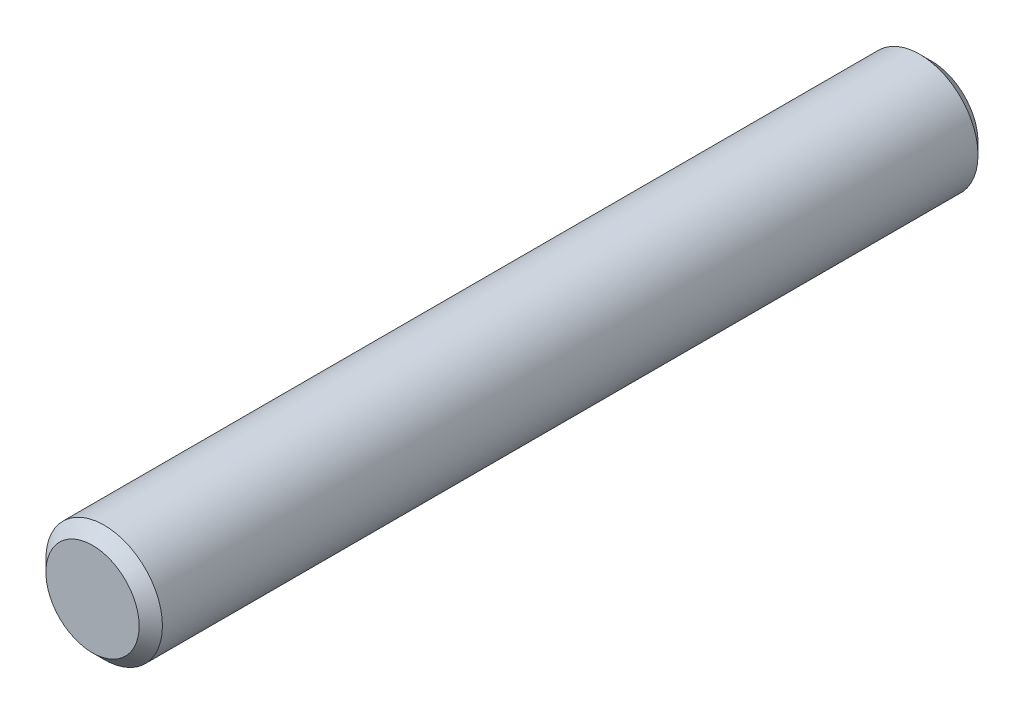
ISO-10303-21;
HEADER;
FILE_DESCRIPTION(('STEP AP214'),'2;1');
FILE_NAME('part.step','',(''),(''),'','','');
FILE_SCHEMA(('AUTOMOTIVE_DESIGN { 1 0 10303 214 1 1 1 1 }'));
ENDSEC;
DATA;
#1=APPLICATION_CONTEXT('core data for automotive mechanical design processes');
#2=APPLICATION_PROTOCOL_DEFINITION('international standard','automotive_design',2000,#1);
#3=PRODUCT_CONTEXT('',#1,'mechanical');
#4=PRODUCT('Part','Part','',(#3));
#5=PRODUCT_RELATED_PRODUCT_CATEGORY('part','',(#4));
#6=PRODUCT_DEFINITION_FORMATION('','',#4);
#7=PRODUCT_DEFINITION_CONTEXT('part definition',#1,'design');
#8=PRODUCT_DEFINITION('design','',#6,#7);
#9=PRODUCT_DEFINITION_SHAPE('','',#8);
#10=(LENGTH_UNIT() NAMED_UNIT(*) SI_UNIT(.MILLI.,.METRE.));
#11=(NAMED_UNIT(*) PLANE_ANGLE_UNIT() SI_UNIT($,.RADIAN.));
#12=(NAMED_UNIT(*) SI_UNIT($,.STERADIAN.) SOLID_ANGLE_UNIT());
#13=UNCERTAINTY_MEASURE_WITH_UNIT(LENGTH_MEASURE(1.E-05),#10,'distance_accuracy_value','');
#14=(GEOMETRIC_REPRESENTATION_CONTEXT(3) GLOBAL_UNCERTAINTY_ASSIGNED_CONTEXT((#13)) GLOBAL_UNIT_ASSIGNED_CONTEXT((#10,
#11,#12)) REPRESENTATION_CONTEXT('',''));
#15=CARTESIAN_POINT('',(0.,0.,0.));
#16=DIRECTION('',(0.,0.,1.));
#17=DIRECTION('',(1.,0.,0.));
#18=AXIS2_PLACEMENT_3D('',#15,#16,#17);
#19=CARTESIAN_POINT('',(-11.8089324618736,14.6289760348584,72.));
#20=DIRECTION('',(0.,0.,-1.));
#21=DIRECTION('',(-1.,0.,0.));
#22=AXIS2_PLACEMENT_3D('',#19,#20,#21);
#23=CYLINDRICAL_SURFACE('',#22,5.);
#24=CARTESIAN_POINT('',(-11.8089324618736,14.6289760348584,1.00000000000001));
#25=DIRECTION('',(0.,0.,1.));
#26=DIRECTION('',(1.,0.,0.));
#27=AXIS2_PLACEMENT_3D('',#24,#25,#26);
#28=CIRCLE('',#27,5.);
#29=CARTESIAN_POINT('',(-6.80893246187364,14.6289760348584,1.00000000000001));
#30=VERTEX_POINT('',#29);
#31=EDGE_CURVE('E39',#30,#30,#28,.T.);
#32=ORIENTED_EDGE('',*,*,#31,.T.);
#33=EDGE_LOOP('',(#32));
#34=FACE_BOUND('',#33,.T.);
#35=CARTESIAN_POINT('',(-11.8089324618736,14.6289760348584,71.));
#36=DIRECTION('',(0.,0.,1.));
#37=DIRECTION('',(1.,0.,0.));
#38=AXIS2_PLACEMENT_3D('',#35,#36,#37);
#39=CIRCLE('',#38,5.);
#40=CARTESIAN_POINT('',(-6.80893246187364,14.6289760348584,71.));
#41=VERTEX_POINT('',#40);
#42=EDGE_CURVE('E43',#41,#41,#39,.F.);
#43=ORIENTED_EDGE('',*,*,#42,.T.);
#44=EDGE_LOOP('',(#43));
#45=FACE_BOUND('',#44,.T.);
#46=ADVANCED_FACE('F28',(#34,#45),#23,.T.);
#47=CARTESIAN_POINT('',(-11.8089324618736,14.6289760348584,72.));
#48=DIRECTION('',(0.,0.,1.));
#49=DIRECTION('',(1.,0.,0.));
#50=AXIS2_PLACEMENT_3D('',#47,#48,#49);
#51=PLANE('',#50);
#52=CARTESIAN_POINT('',(-11.8089324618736,14.6289760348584,72.));
#53=DIRECTION('',(0.,0.,1.));
#54=DIRECTION('',(1.,0.,0.));
#55=AXIS2_PLACEMENT_3D('',#52,#53,#54);
#56=CIRCLE('',#55,4.);
#57=CARTESIAN_POINT('',(-7.80893246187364,14.6289760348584,72.));
#58=VERTEX_POINT('',#57);
#59=EDGE_CURVE('E10',#58,#58,#56,.T.);
#60=ORIENTED_EDGE('',*,*,#59,.T.);
#61=EDGE_LOOP('',(#60));
#62=FACE_BOUND('',#61,.T.);
#63=ADVANCED_FACE('F59',(#62),#51,.T.);
#64=CARTESIAN_POINT('',(-11.8089324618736,14.6289760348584,0.));
#65=DIRECTION('',(0.,0.,1.));
#66=DIRECTION('',(1.,0.,0.));
#67=AXIS2_PLACEMENT_3D('',#64,#65,#66);
#68=PLANE('',#67);
#69=CARTESIAN_POINT('',(-11.8089324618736,14.6289760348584,0.));
#70=DIRECTION('',(0.,0.,1.));
#71=DIRECTION('',(1.,0.,0.));
#72=AXIS2_PLACEMENT_3D('',#69,#70,#71);
#73=CIRCLE('',#72,4.);
#74=CARTESIAN_POINT('',(-7.80893246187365,14.6289760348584,0.));
#75=VERTEX_POINT('',#74);
#76=EDGE_CURVE('E35',#75,#75,#73,.F.);
#77=ORIENTED_EDGE('',*,*,#76,.T.);
#78=EDGE_LOOP('',(#77));
#79=FACE_BOUND('',#78,.T.);
#80=ADVANCED_FACE('F56',(#79),#68,.F.);
#81=CARTESIAN_POINT('',(-11.8089324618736,14.6289760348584,1.00000000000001));
#82=DIRECTION('',(0.,0.,1.));
#83=DIRECTION('',(1.,0.,0.));
#84=AXIS2_PLACEMENT_3D('',#81,#82,#83);
#85=CONICAL_SURFACE('',#84,5.,0.785398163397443);
#86=ORIENTED_EDGE('',*,*,#76,.F.);
#87=EDGE_LOOP('',(#86));
#88=FACE_BOUND('',#87,.T.);
#89=ORIENTED_EDGE('',*,*,#31,.F.);
#90=EDGE_LOOP('',(#89));
#91=FACE_BOUND('',#90,.T.);
#92=ADVANCED_FACE('F52',(#88,#91),#85,.T.);
#93=CARTESIAN_POINT('',(-11.8089324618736,14.6289760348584,72.));
#94=DIRECTION('',(0.,0.,-1.));
#95=DIRECTION('',(-1.,0.,0.));
#96=AXIS2_PLACEMENT_3D('',#93,#94,#95);
#97=CONICAL_SURFACE('',#96,4.,0.785398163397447);
#98=ORIENTED_EDGE('',*,*,#42,.F.);
#99=EDGE_LOOP('',(#98));
#100=FACE_BOUND('',#99,.T.);
#101=ORIENTED_EDGE('',*,*,#59,.F.);
#102=EDGE_LOOP('',(#101));
#103=FACE_BOUND('',#102,.T.);
#104=ADVANCED_FACE('F30',(#100,#103),#97,.T.);
#105=CLOSED_SHELL('',(#46,#63,#80,#92,#104));
#106=MANIFOLD_SOLID_BREP('B2',#105);
#107=ADVANCED_BREP_SHAPE_REPRESENTATION('',(#18,#106),#14);
#108=SHAPE_DEFINITION_REPRESENTATION(#9,#107);
ENDSEC;
END-ISO-10303-21;
